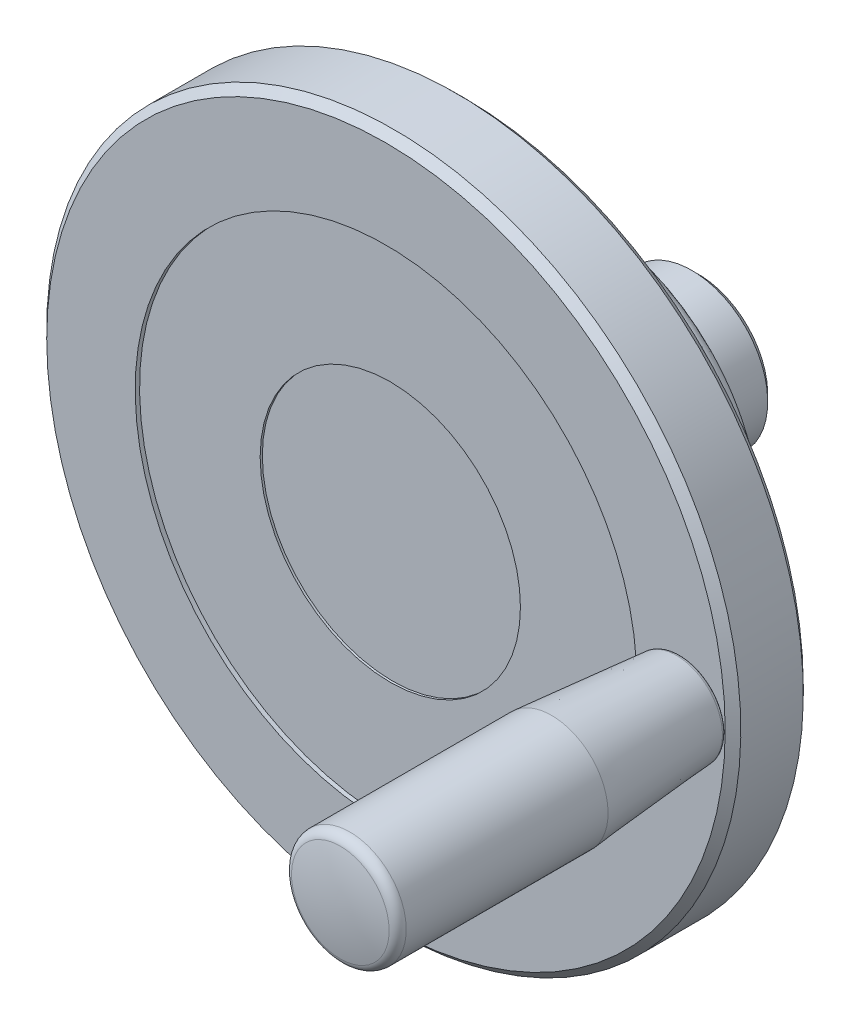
ISO-10303-21;
HEADER;
FILE_DESCRIPTION(('STEP AP214'),'2;1');
FILE_NAME('part.step','',(''),(''),'','','');
FILE_SCHEMA(('AUTOMOTIVE_DESIGN { 1 0 10303 214 1 1 1 1 }'));
ENDSEC;
DATA;
#1=APPLICATION_CONTEXT('core data for automotive mechanical design processes');
#2=APPLICATION_PROTOCOL_DEFINITION('international standard','automotive_design',2000,#1);
#3=PRODUCT_CONTEXT('',#1,'mechanical');
#4=PRODUCT('Part','Part','',(#3));
#5=PRODUCT_RELATED_PRODUCT_CATEGORY('part','',(#4));
#6=PRODUCT_DEFINITION_FORMATION('','',#4);
#7=PRODUCT_DEFINITION_CONTEXT('part definition',#1,'design');
#8=PRODUCT_DEFINITION('design','',#6,#7);
#9=PRODUCT_DEFINITION_SHAPE('','',#8);
#10=(LENGTH_UNIT() NAMED_UNIT(*) SI_UNIT(.MILLI.,.METRE.));
#11=(NAMED_UNIT(*) PLANE_ANGLE_UNIT() SI_UNIT($,.RADIAN.));
#12=(NAMED_UNIT(*) SI_UNIT($,.STERADIAN.) SOLID_ANGLE_UNIT());
#13=UNCERTAINTY_MEASURE_WITH_UNIT(LENGTH_MEASURE(1.E-05),#10,'distance_accuracy_value','');
#14=(GEOMETRIC_REPRESENTATION_CONTEXT(3) GLOBAL_UNCERTAINTY_ASSIGNED_CONTEXT((#13)) GLOBAL_UNIT_ASSIGNED_CONTEXT((#10,
#11,#12)) REPRESENTATION_CONTEXT('',''));
#15=CARTESIAN_POINT('',(0.,0.,0.));
#16=DIRECTION('',(0.,0.,1.));
#17=DIRECTION('',(1.,0.,0.));
#18=AXIS2_PLACEMENT_3D('',#15,#16,#17);
#19=CARTESIAN_POINT('',(-78.2,0.,72.));
#20=DIRECTION('',(0.,0.,-1.));
#21=DIRECTION('',(0.,1.,0.));
#22=AXIS2_PLACEMENT_3D('',#19,#20,#21);
#23=PLANE('',#22);
#24=CARTESIAN_POINT('',(0.,0.,72.));
#25=DIRECTION('',(0.,0.,1.));
#26=DIRECTION('',(0.,-1.,0.));
#27=AXIS2_PLACEMENT_3D('',#24,#25,#26);
#28=CIRCLE('',#27,78.2);
#29=CARTESIAN_POINT('',(0.,-78.2,72.));
#30=VERTEX_POINT('',#29);
#31=EDGE_CURVE('E71',#30,#30,#28,.T.);
#32=ORIENTED_EDGE('',*,*,#31,.T.);
#33=EDGE_LOOP('',(#32));
#34=FACE_BOUND('',#33,.T.);
#35=CARTESIAN_POINT('',(0.,0.,72.));
#36=DIRECTION('',(0.,0.,1.));
#37=DIRECTION('',(0.,-1.,0.));
#38=AXIS2_PLACEMENT_3D('',#35,#36,#37);
#39=CIRCLE('',#38,57.8);
#40=CARTESIAN_POINT('',(0.,-57.8,72.));
#41=VERTEX_POINT('',#40);
#42=EDGE_CURVE('E50',#41,#41,#39,.T.);
#43=ORIENTED_EDGE('',*,*,#42,.F.);
#44=EDGE_LOOP('',(#43));
#45=FACE_BOUND('',#44,.T.);
#46=CARTESIAN_POINT('',(68.2,0.,72.));
#47=DIRECTION('',(0.,0.,1.));
#48=DIRECTION('',(0.,-1.,0.));
#49=AXIS2_PLACEMENT_3D('',#46,#47,#48);
#50=CIRCLE('',#49,6.);
#51=CARTESIAN_POINT('',(68.2,-6.,72.));
#52=VERTEX_POINT('',#51);
#53=EDGE_CURVE('E8',#52,#52,#50,.T.);
#54=ORIENTED_EDGE('',*,*,#53,.F.);
#55=EDGE_LOOP('',(#54));
#56=FACE_BOUND('',#55,.T.);
#57=ADVANCED_FACE('F12',(#34,#45,#56),#23,.F.);
#58=CARTESIAN_POINT('',(0.,0.,27.5));
#59=DIRECTION('',(0.,0.,1.));
#60=DIRECTION('',(0.,-1.,0.));
#61=AXIS2_PLACEMENT_3D('',#58,#59,#60);
#62=TOROIDAL_SURFACE('',#61,38.1275885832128,2.50000000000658);
#63=CARTESIAN_POINT('',(0.,0.,25.));
#64=DIRECTION('',(0.,0.,1.));
#65=DIRECTION('',(0.,-1.,0.));
#66=AXIS2_PLACEMENT_3D('',#63,#64,#65);
#67=CIRCLE('',#66,38.1275966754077);
#68=CARTESIAN_POINT('',(0.,-38.1275966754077,25.));
#69=VERTEX_POINT('',#68);
#70=EDGE_CURVE('E16',#69,#69,#67,.T.);
#71=ORIENTED_EDGE('',*,*,#70,.T.);
#72=EDGE_LOOP('',(#71));
#73=FACE_BOUND('',#72,.T.);
#74=CARTESIAN_POINT('',(0.,0.,27.369160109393));
#75=DIRECTION('',(0.,0.,1.));
#76=DIRECTION('',(0.,-1.,0.));
#77=AXIS2_PLACEMENT_3D('',#74,#75,#76);
#78=CIRCLE('',#77,40.6241624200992);
#79=CARTESIAN_POINT('',(0.,-40.6241624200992,27.369160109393));
#80=VERTEX_POINT('',#79);
#81=EDGE_CURVE('E56',#80,#80,#78,.T.);
#82=ORIENTED_EDGE('',*,*,#81,.F.);
#83=EDGE_LOOP('',(#82));
#84=FACE_BOUND('',#83,.T.);
#85=ADVANCED_FACE('F14',(#73,#84),#62,.T.);
#86=CARTESIAN_POINT('',(-29.,0.,25.));
#87=DIRECTION('',(0.,0.,1.));
#88=DIRECTION('',(0.,-1.,0.));
#89=AXIS2_PLACEMENT_3D('',#86,#87,#88);
#90=PLANE('',#89);
#91=ORIENTED_EDGE('',*,*,#70,.F.);
#92=EDGE_LOOP('',(#91));
#93=FACE_BOUND('',#92,.T.);
#94=CARTESIAN_POINT('',(0.,0.,25.));
#95=DIRECTION('',(0.,0.,1.));
#96=DIRECTION('',(0.,-1.,0.));
#97=AXIS2_PLACEMENT_3D('',#94,#95,#96);
#98=CIRCLE('',#97,29.);
#99=CARTESIAN_POINT('',(0.,-29.,25.));
#100=VERTEX_POINT('',#99);
#101=EDGE_CURVE('E24',#100,#100,#98,.T.);
#102=ORIENTED_EDGE('',*,*,#101,.T.);
#103=EDGE_LOOP('',(#102));
#104=FACE_BOUND('',#103,.T.);
#105=ADVANCED_FACE('F94',(#93,#104),#90,.F.);
#106=CARTESIAN_POINT('',(0.,0.,22.5));
#107=DIRECTION('',(0.,0.,1.));
#108=DIRECTION('',(0.,-1.,0.));
#109=AXIS2_PLACEMENT_3D('',#106,#107,#108);
#110=TOROIDAL_SURFACE('',#109,29.,2.49999999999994);
#111=ORIENTED_EDGE('',*,*,#101,.F.);
#112=EDGE_LOOP('',(#111));
#113=FACE_BOUND('',#112,.T.);
#114=CARTESIAN_POINT('',(0.,0.,22.5));
#115=DIRECTION('',(0.,0.,1.));
#116=DIRECTION('',(0.,-1.,0.));
#117=AXIS2_PLACEMENT_3D('',#114,#115,#116);
#118=CIRCLE('',#117,26.5);
#119=CARTESIAN_POINT('',(0.,-26.5,22.5));
#120=VERTEX_POINT('',#119);
#121=EDGE_CURVE('E89',#120,#120,#118,.T.);
#122=ORIENTED_EDGE('',*,*,#121,.T.);
#123=EDGE_LOOP('',(#122));
#124=FACE_BOUND('',#123,.T.);
#125=ADVANCED_FACE('F96',(#113,#124),#110,.F.);
#126=CARTESIAN_POINT('',(0.,0.,96.840186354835));
#127=DIRECTION('',(0.,0.,1.));
#128=DIRECTION('',(0.,-1.,0.));
#129=AXIS2_PLACEMENT_3D('',#126,#127,#128);
#130=CYLINDRICAL_SURFACE('',#129,26.5);
#131=CARTESIAN_POINT('',(0.,0.,16.8));
#132=DIRECTION('',(0.,0.,1.));
#133=DIRECTION('',(0.,-1.,0.));
#134=AXIS2_PLACEMENT_3D('',#131,#132,#133);
#135=CIRCLE('',#134,26.5);
#136=CARTESIAN_POINT('',(0.,-26.5,16.8));
#137=VERTEX_POINT('',#136);
#138=EDGE_CURVE('E86',#137,#137,#135,.T.);
#139=ORIENTED_EDGE('',*,*,#138,.T.);
#140=EDGE_LOOP('',(#139));
#141=FACE_BOUND('',#140,.T.);
#142=ORIENTED_EDGE('',*,*,#121,.F.);
#143=EDGE_LOOP('',(#142));
#144=FACE_BOUND('',#143,.T.);
#145=ADVANCED_FACE('F99',(#141,#144),#130,.T.);
#146=CARTESIAN_POINT('',(0.,0.,15.));
#147=DIRECTION('',(0.,0.,1.));
#148=DIRECTION('',(0.,-1.,0.));
#149=AXIS2_PLACEMENT_3D('',#146,#147,#148);
#150=CONICAL_SURFACE('',#149,24.7,0.785398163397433);
#151=ORIENTED_EDGE('',*,*,#138,.F.);
#152=EDGE_LOOP('',(#151));
#153=FACE_BOUND('',#152,.T.);
#154=CARTESIAN_POINT('',(0.,0.,15.));
#155=DIRECTION('',(0.,0.,1.));
#156=DIRECTION('',(0.,-1.,0.));
#157=AXIS2_PLACEMENT_3D('',#154,#155,#156);
#158=CIRCLE('',#157,24.7);
#159=CARTESIAN_POINT('',(0.,-24.7,15.));
#160=VERTEX_POINT('',#159);
#161=EDGE_CURVE('E83',#160,#160,#158,.T.);
#162=ORIENTED_EDGE('',*,*,#161,.T.);
#163=EDGE_LOOP('',(#162));
#164=FACE_BOUND('',#163,.T.);
#165=ADVANCED_FACE('F104',(#153,#164),#150,.T.);
#166=CARTESIAN_POINT('',(-17.5,0.,15.));
#167=DIRECTION('',(0.,0.,1.));
#168=DIRECTION('',(0.,-1.,0.));
#169=AXIS2_PLACEMENT_3D('',#166,#167,#168);
#170=PLANE('',#169);
#171=ORIENTED_EDGE('',*,*,#161,.F.);
#172=EDGE_LOOP('',(#171));
#173=FACE_BOUND('',#172,.T.);
#174=CARTESIAN_POINT('',(0.,0.,15.));
#175=DIRECTION('',(0.,0.,1.));
#176=DIRECTION('',(0.,-1.,0.));
#177=AXIS2_PLACEMENT_3D('',#174,#175,#176);
#178=CIRCLE('',#177,17.5);
#179=CARTESIAN_POINT('',(0.,-17.5,15.));
#180=VERTEX_POINT('',#179);
#181=EDGE_CURVE('E80',#180,#180,#178,.T.);
#182=ORIENTED_EDGE('',*,*,#181,.T.);
#183=EDGE_LOOP('',(#182));
#184=FACE_BOUND('',#183,.T.);
#185=ADVANCED_FACE('F112',(#173,#184),#170,.F.);
#186=CARTESIAN_POINT('',(0.,0.,96.840186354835));
#187=DIRECTION('',(0.,0.,1.));
#188=DIRECTION('',(0.,-1.,0.));
#189=AXIS2_PLACEMENT_3D('',#186,#187,#188);
#190=CYLINDRICAL_SURFACE('',#189,17.5);
#191=CARTESIAN_POINT('',(0.,0.,1.49999999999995));
#192=DIRECTION('',(0.,0.,1.));
#193=DIRECTION('',(0.,-1.,0.));
#194=AXIS2_PLACEMENT_3D('',#191,#192,#193);
#195=CIRCLE('',#194,17.5);
#196=CARTESIAN_POINT('',(0.,-17.5,1.49999999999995));
#197=VERTEX_POINT('',#196);
#198=EDGE_CURVE('E77',#197,#197,#195,.T.);
#199=ORIENTED_EDGE('',*,*,#198,.T.);
#200=EDGE_LOOP('',(#199));
#201=FACE_BOUND('',#200,.T.);
#202=ORIENTED_EDGE('',*,*,#181,.F.);
#203=EDGE_LOOP('',(#202));
#204=FACE_BOUND('',#203,.T.);
#205=ADVANCED_FACE('F135',(#201,#204),#190,.T.);
#206=CARTESIAN_POINT('',(0.,0.,0.));
#207=DIRECTION('',(0.,0.,1.));
#208=DIRECTION('',(0.,-1.,0.));
#209=AXIS2_PLACEMENT_3D('',#206,#207,#208);
#210=CONICAL_SURFACE('',#209,16.,0.785398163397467);
#211=ORIENTED_EDGE('',*,*,#198,.F.);
#212=EDGE_LOOP('',(#211));
#213=FACE_BOUND('',#212,.T.);
#214=CARTESIAN_POINT('',(0.,0.,0.));
#215=DIRECTION('',(0.,0.,1.));
#216=DIRECTION('',(0.,-1.,0.));
#217=AXIS2_PLACEMENT_3D('',#214,#215,#216);
#218=CIRCLE('',#217,16.);
#219=CARTESIAN_POINT('',(0.,-16.,0.));
#220=VERTEX_POINT('',#219);
#221=EDGE_CURVE('E74',#220,#220,#218,.T.);
#222=ORIENTED_EDGE('',*,*,#221,.T.);
#223=EDGE_LOOP('',(#222));
#224=FACE_BOUND('',#223,.T.);
#225=ADVANCED_FACE('F131',(#213,#224),#210,.T.);
#226=CARTESIAN_POINT('',(0.,0.,0.));
#227=DIRECTION('',(0.,0.,1.));
#228=DIRECTION('',(0.,-1.,0.));
#229=AXIS2_PLACEMENT_3D('',#226,#227,#228);
#230=PLANE('',#229);
#231=ORIENTED_EDGE('',*,*,#221,.F.);
#232=EDGE_LOOP('',(#231));
#233=FACE_BOUND('',#232,.T.);
#234=ADVANCED_FACE('F128',(#233),#230,.F.);
#235=CARTESIAN_POINT('',(0.,0.,70.2));
#236=DIRECTION('',(0.,0.,-1.));
#237=DIRECTION('',(0.,1.,0.));
#238=AXIS2_PLACEMENT_3D('',#235,#236,#237);
#239=CONICAL_SURFACE('',#238,80.,0.785398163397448);
#240=ORIENTED_EDGE('',*,*,#31,.F.);
#241=EDGE_LOOP('',(#240));
#242=FACE_BOUND('',#241,.T.);
#243=CARTESIAN_POINT('',(0.,0.,70.2));
#244=DIRECTION('',(0.,0.,1.));
#245=DIRECTION('',(0.,-1.,0.));
#246=AXIS2_PLACEMENT_3D('',#243,#244,#245);
#247=CIRCLE('',#246,80.);
#248=CARTESIAN_POINT('',(0.,-80.,70.2));
#249=VERTEX_POINT('',#248);
#250=EDGE_CURVE('E68',#249,#249,#247,.T.);
#251=ORIENTED_EDGE('',*,*,#250,.T.);
#252=EDGE_LOOP('',(#251));
#253=FACE_BOUND('',#252,.T.);
#254=ADVANCED_FACE('F126',(#242,#253),#239,.T.);
#255=CARTESIAN_POINT('',(0.,0.,96.840186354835));
#256=DIRECTION('',(0.,0.,1.));
#257=DIRECTION('',(0.,-1.,0.));
#258=AXIS2_PLACEMENT_3D('',#255,#256,#257);
#259=CYLINDRICAL_SURFACE('',#258,80.);
#260=ORIENTED_EDGE('',*,*,#250,.F.);
#261=EDGE_LOOP('',(#260));
#262=FACE_BOUND('',#261,.T.);
#263=CARTESIAN_POINT('',(0.,0.,55.8));
#264=DIRECTION('',(0.,0.,1.));
#265=DIRECTION('',(0.,-1.,0.));
#266=AXIS2_PLACEMENT_3D('',#263,#264,#265);
#267=CIRCLE('',#266,80.);
#268=CARTESIAN_POINT('',(0.,-80.,55.8));
#269=VERTEX_POINT('',#268);
#270=EDGE_CURVE('E65',#269,#269,#267,.T.);
#271=ORIENTED_EDGE('',*,*,#270,.T.);
#272=EDGE_LOOP('',(#271));
#273=FACE_BOUND('',#272,.T.);
#274=ADVANCED_FACE('F179',(#262,#273),#259,.T.);
#275=CARTESIAN_POINT('',(0.,0.,54.));
#276=DIRECTION('',(0.,0.,1.));
#277=DIRECTION('',(0.,-1.,0.));
#278=AXIS2_PLACEMENT_3D('',#275,#276,#277);
#279=CONICAL_SURFACE('',#278,78.2,0.785398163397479);
#280=ORIENTED_EDGE('',*,*,#270,.F.);
#281=EDGE_LOOP('',(#280));
#282=FACE_BOUND('',#281,.T.);
#283=CARTESIAN_POINT('',(0.,0.,54.));
#284=DIRECTION('',(0.,0.,1.));
#285=DIRECTION('',(0.,-1.,0.));
#286=AXIS2_PLACEMENT_3D('',#283,#284,#285);
#287=CIRCLE('',#286,78.2);
#288=CARTESIAN_POINT('',(0.,-78.2,54.));
#289=VERTEX_POINT('',#288);
#290=EDGE_CURVE('E62',#289,#289,#287,.T.);
#291=ORIENTED_EDGE('',*,*,#290,.T.);
#292=EDGE_LOOP('',(#291));
#293=FACE_BOUND('',#292,.T.);
#294=ADVANCED_FACE('F187',(#282,#293),#279,.T.);
#295=CARTESIAN_POINT('',(-78.2,0.,54.));
#296=DIRECTION('',(0.,0.,-1.));
#297=DIRECTION('',(0.,1.,0.));
#298=AXIS2_PLACEMENT_3D('',#295,#296,#297);
#299=PLANE('',#298);
#300=CARTESIAN_POINT('',(0.,0.,54.));
#301=DIRECTION('',(0.,0.,1.));
#302=DIRECTION('',(0.,-1.,0.));
#303=AXIS2_PLACEMENT_3D('',#300,#301,#302);
#304=CIRCLE('',#303,42.0198255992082);
#305=CARTESIAN_POINT('',(0.,-42.0198255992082,54.));
#306=VERTEX_POINT('',#305);
#307=EDGE_CURVE('E59',#306,#306,#304,.T.);
#308=ORIENTED_EDGE('',*,*,#307,.T.);
#309=EDGE_LOOP('',(#308));
#310=FACE_BOUND('',#309,.T.);
#311=ORIENTED_EDGE('',*,*,#290,.F.);
#312=EDGE_LOOP('',(#311));
#313=FACE_BOUND('',#312,.T.);
#314=ADVANCED_FACE('F195',(#310,#313),#299,.T.);
#315=CARTESIAN_POINT('',(0.,0.,27.369160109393));
#316=DIRECTION('',(0.,0.,1.));
#317=DIRECTION('',(0.,-1.,0.));
#318=AXIS2_PLACEMENT_3D('',#315,#316,#317);
#319=CONICAL_SURFACE('',#318,40.6241624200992,0.0523598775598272);
#320=ORIENTED_EDGE('',*,*,#307,.F.);
#321=EDGE_LOOP('',(#320));
#322=FACE_BOUND('',#321,.T.);
#323=ORIENTED_EDGE('',*,*,#81,.T.);
#324=EDGE_LOOP('',(#323));
#325=FACE_BOUND('',#324,.T.);
#326=ADVANCED_FACE('F204',(#322,#325),#319,.T.);
#327=CARTESIAN_POINT('',(0.,0.,71.));
#328=DIRECTION('',(0.,0.,1.));
#329=DIRECTION('',(0.,-1.,0.));
#330=AXIS2_PLACEMENT_3D('',#327,#328,#329);
#331=CYLINDRICAL_SURFACE('',#330,57.8);
#332=CARTESIAN_POINT('',(0.,0.,71.));
#333=DIRECTION('',(0.,0.,1.));
#334=DIRECTION('',(0.,-1.,0.));
#335=AXIS2_PLACEMENT_3D('',#332,#333,#334);
#336=CIRCLE('',#335,57.8);
#337=CARTESIAN_POINT('',(0.,-57.8,71.));
#338=VERTEX_POINT('',#337);
#339=EDGE_CURVE('E53',#338,#338,#336,.T.);
#340=ORIENTED_EDGE('',*,*,#339,.F.);
#341=EDGE_LOOP('',(#340));
#342=FACE_BOUND('',#341,.T.);
#343=ORIENTED_EDGE('',*,*,#42,.T.);
#344=EDGE_LOOP('',(#343));
#345=FACE_BOUND('',#344,.T.);
#346=ADVANCED_FACE('F213',(#342,#345),#331,.F.);
#347=CARTESIAN_POINT('',(0.,0.,71.));
#348=DIRECTION('',(0.,0.,1.));
#349=DIRECTION('',(0.,-1.,0.));
#350=AXIS2_PLACEMENT_3D('',#347,#348,#349);
#351=PLANE('',#350);
#352=CARTESIAN_POINT('',(0.,0.,71.));
#353=DIRECTION('',(0.,0.,1.));
#354=DIRECTION('',(0.,-1.,0.));
#355=AXIS2_PLACEMENT_3D('',#352,#353,#354);
#356=CIRCLE('',#355,30.);
#357=CARTESIAN_POINT('',(0.,-30.,71.));
#358=VERTEX_POINT('',#357);
#359=EDGE_CURVE('E47',#358,#358,#356,.T.);
#360=ORIENTED_EDGE('',*,*,#359,.F.);
#361=EDGE_LOOP('',(#360));
#362=FACE_BOUND('',#361,.T.);
#363=ORIENTED_EDGE('',*,*,#339,.T.);
#364=EDGE_LOOP('',(#363));
#365=FACE_BOUND('',#364,.T.);
#366=ADVANCED_FACE('F216',(#362,#365),#351,.T.);
#367=CARTESIAN_POINT('',(0.,0.,70.5));
#368=DIRECTION('',(0.,0.,1.));
#369=DIRECTION('',(0.,-1.,0.));
#370=AXIS2_PLACEMENT_3D('',#367,#368,#369);
#371=CYLINDRICAL_SURFACE('',#370,30.);
#372=ORIENTED_EDGE('',*,*,#359,.T.);
#373=EDGE_LOOP('',(#372));
#374=FACE_BOUND('',#373,.T.);
#375=CARTESIAN_POINT('',(0.,0.,70.5));
#376=DIRECTION('',(0.,0.,1.));
#377=DIRECTION('',(0.,-1.,0.));
#378=AXIS2_PLACEMENT_3D('',#375,#376,#377);
#379=CIRCLE('',#378,30.);
#380=CARTESIAN_POINT('',(0.,-30.,70.5));
#381=VERTEX_POINT('',#380);
#382=EDGE_CURVE('E44',#381,#381,#379,.T.);
#383=ORIENTED_EDGE('',*,*,#382,.F.);
#384=EDGE_LOOP('',(#383));
#385=FACE_BOUND('',#384,.T.);
#386=ADVANCED_FACE('F232',(#374,#385),#371,.F.);
#387=CARTESIAN_POINT('',(0.,0.,70.5));
#388=DIRECTION('',(0.,0.,1.));
#389=DIRECTION('',(0.,-1.,0.));
#390=AXIS2_PLACEMENT_3D('',#387,#388,#389);
#391=PLANE('',#390);
#392=ORIENTED_EDGE('',*,*,#382,.T.);
#393=EDGE_LOOP('',(#392));
#394=FACE_BOUND('',#393,.T.);
#395=ADVANCED_FACE('F225',(#394),#391,.T.);
#396=CARTESIAN_POINT('',(68.2,0.,102.));
#397=DIRECTION('',(0.,-1.,0.));
#398=DIRECTION('',(0.,0.,-1.));
#399=AXIS2_PLACEMENT_3D('',#396,#397,#398);
#400=SPHERICAL_SURFACE('',#399,50.);
#401=CARTESIAN_POINT('',(68.2,0.,102.));
#402=DIRECTION('',(0.,0.,1.));
#403=DIRECTION('',(0.,-1.,0.));
#404=AXIS2_PLACEMENT_3D('',#401,#402,#403);
#405=SPHERICAL_SURFACE('',#404,50.);
#406=CARTESIAN_POINT('',(68.2,0.,150.716426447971));
#407=DIRECTION('',(0.,0.,1.));
#408=DIRECTION('',(0.,-1.,0.));
#409=AXIS2_PLACEMENT_3D('',#406,#407,#408);
#410=CIRCLE('',#409,11.2565445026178);
#411=CARTESIAN_POINT('',(68.2,-11.2565445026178,150.716426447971));
#412=VERTEX_POINT('',#411);
#413=EDGE_CURVE('E41',#412,#412,#410,.T.);
#414=ORIENTED_EDGE('',*,*,#413,.T.);
#415=EDGE_LOOP('',(#414));
#416=FACE_BOUND('',#415,.T.);
#417=ADVANCED_FACE('F243',(#416),#405,.T.);
#418=CARTESIAN_POINT('',(68.2,0.,148.524187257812));
#419=DIRECTION('',(0.,0.,1.));
#420=DIRECTION('',(0.,-1.,0.));
#421=AXIS2_PLACEMENT_3D('',#418,#419,#420);
#422=TOROIDAL_SURFACE('',#421,10.75,2.25);
#423=CARTESIAN_POINT('',(68.2,0.,148.524187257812));
#424=DIRECTION('',(0.,0.,1.));
#425=DIRECTION('',(0.,-1.,0.));
#426=AXIS2_PLACEMENT_3D('',#423,#424,#425);
#427=CIRCLE('',#426,13.);
#428=CARTESIAN_POINT('',(68.2,-13.,148.524187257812));
#429=VERTEX_POINT('',#428);
#430=EDGE_CURVE('E38',#429,#429,#427,.T.);
#431=ORIENTED_EDGE('',*,*,#430,.T.);
#432=EDGE_LOOP('',(#431));
#433=FACE_BOUND('',#432,.T.);
#434=ORIENTED_EDGE('',*,*,#413,.F.);
#435=EDGE_LOOP('',(#434));
#436=FACE_BOUND('',#435,.T.);
#437=ADVANCED_FACE('F258',(#433,#436),#422,.T.);
#438=CARTESIAN_POINT('',(68.2,0.,174.106156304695));
#439=DIRECTION('',(0.,0.,1.));
#440=DIRECTION('',(0.,-1.,0.));
#441=AXIS2_PLACEMENT_3D('',#438,#439,#440);
#442=CYLINDRICAL_SURFACE('',#441,13.);
#443=CARTESIAN_POINT('',(68.2,0.,102.));
#444=DIRECTION('',(0.,0.,1.));
#445=DIRECTION('',(0.,-1.,0.));
#446=AXIS2_PLACEMENT_3D('',#443,#444,#445);
#447=CIRCLE('',#446,13.);
#448=CARTESIAN_POINT('',(68.2,-13.,102.));
#449=VERTEX_POINT('',#448);
#450=EDGE_CURVE('E35',#449,#449,#447,.T.);
#451=ORIENTED_EDGE('',*,*,#450,.T.);
#452=EDGE_LOOP('',(#451));
#453=FACE_BOUND('',#452,.T.);
#454=ORIENTED_EDGE('',*,*,#430,.F.);
#455=EDGE_LOOP('',(#454));
#456=FACE_BOUND('',#455,.T.);
#457=ADVANCED_FACE('F267',(#453,#456),#442,.T.);
#458=CARTESIAN_POINT('',(68.2,0.,73.216121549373));
#459=DIRECTION('',(0.,0.,1.));
#460=DIRECTION('',(0.,-1.,0.));
#461=AXIS2_PLACEMENT_3D('',#458,#459,#460);
#462=CONICAL_SURFACE('',#461,10.577114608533,0.08397711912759);
#463=ORIENTED_EDGE('',*,*,#450,.F.);
#464=EDGE_LOOP('',(#463));
#465=FACE_BOUND('',#464,.T.);
#466=CARTESIAN_POINT('',(68.2,0.,73.216121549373));
#467=DIRECTION('',(0.,0.,1.));
#468=DIRECTION('',(0.,-1.,0.));
#469=AXIS2_PLACEMENT_3D('',#466,#467,#468);
#470=CIRCLE('',#469,10.577114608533);
#471=CARTESIAN_POINT('',(68.2,-10.577114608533,73.216121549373));
#472=VERTEX_POINT('',#471);
#473=EDGE_CURVE('E32',#472,#472,#470,.T.);
#474=ORIENTED_EDGE('',*,*,#473,.T.);
#475=EDGE_LOOP('',(#474));
#476=FACE_BOUND('',#475,.T.);
#477=ADVANCED_FACE('F276',(#465,#476),#462,.T.);
#478=CARTESIAN_POINT('',(68.2,0.,73.3));
#479=DIRECTION('',(0.,0.,1.));
#480=DIRECTION('',(0.,-1.,0.));
#481=AXIS2_PLACEMENT_3D('',#478,#479,#480);
#482=TOROIDAL_SURFACE('',#481,9.5806386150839,0.999999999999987);
#483=CARTESIAN_POINT('',(68.2,0.,72.3));
#484=DIRECTION('',(0.,0.,1.));
#485=DIRECTION('',(0.,-1.,0.));
#486=AXIS2_PLACEMENT_3D('',#483,#484,#485);
#487=CIRCLE('',#486,9.5806386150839);
#488=CARTESIAN_POINT('',(68.2,-9.5806386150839,72.3));
#489=VERTEX_POINT('',#488);
#490=EDGE_CURVE('E29',#489,#489,#487,.T.);
#491=ORIENTED_EDGE('',*,*,#490,.T.);
#492=EDGE_LOOP('',(#491));
#493=FACE_BOUND('',#492,.T.);
#494=ORIENTED_EDGE('',*,*,#473,.F.);
#495=EDGE_LOOP('',(#494));
#496=FACE_BOUND('',#495,.T.);
#497=ADVANCED_FACE('F285',(#493,#496),#482,.T.);
#498=CARTESIAN_POINT('',(62.2,0.,72.3));
#499=DIRECTION('',(0.,0.,1.));
#500=DIRECTION('',(0.,-1.,0.));
#501=AXIS2_PLACEMENT_3D('',#498,#499,#500);
#502=PLANE('',#501);
#503=ORIENTED_EDGE('',*,*,#490,.F.);
#504=EDGE_LOOP('',(#503));
#505=FACE_BOUND('',#504,.T.);
#506=CARTESIAN_POINT('',(68.2,0.,72.3));
#507=DIRECTION('',(0.,0.,1.));
#508=DIRECTION('',(0.,-1.,0.));
#509=AXIS2_PLACEMENT_3D('',#506,#507,#508);
#510=CIRCLE('',#509,6.);
#511=CARTESIAN_POINT('',(68.2,-6.,72.3));
#512=VERTEX_POINT('',#511);
#513=EDGE_CURVE('E26',#512,#512,#510,.T.);
#514=ORIENTED_EDGE('',*,*,#513,.T.);
#515=EDGE_LOOP('',(#514));
#516=FACE_BOUND('',#515,.T.);
#517=ADVANCED_FACE('F294',(#505,#516),#502,.F.);
#518=CARTESIAN_POINT('',(68.2,0.,174.106156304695));
#519=DIRECTION('',(0.,0.,1.));
#520=DIRECTION('',(0.,-1.,0.));
#521=AXIS2_PLACEMENT_3D('',#518,#519,#520);
#522=CYLINDRICAL_SURFACE('',#521,6.);
#523=ORIENTED_EDGE('',*,*,#513,.F.);
#524=EDGE_LOOP('',(#523));
#525=FACE_BOUND('',#524,.T.);
#526=ORIENTED_EDGE('',*,*,#53,.T.);
#527=EDGE_LOOP('',(#526));
#528=FACE_BOUND('',#527,.T.);
#529=ADVANCED_FACE('F303',(#525,#528),#522,.T.);
#530=CLOSED_SHELL('',(#57,#85,#105,#125,#145,#165,#185,#205,#225,#234,#254,#274,#294,#314,#326,
#346,#366,#386,#395,#417,#437,#457,#477,#497,#517,#529));
#531=MANIFOLD_SOLID_BREP('B1',#530);
#532=ADVANCED_BREP_SHAPE_REPRESENTATION('',(#18,#531),#14);
#533=SHAPE_DEFINITION_REPRESENTATION(#9,#532);
ENDSEC;
END-ISO-10303-21;
